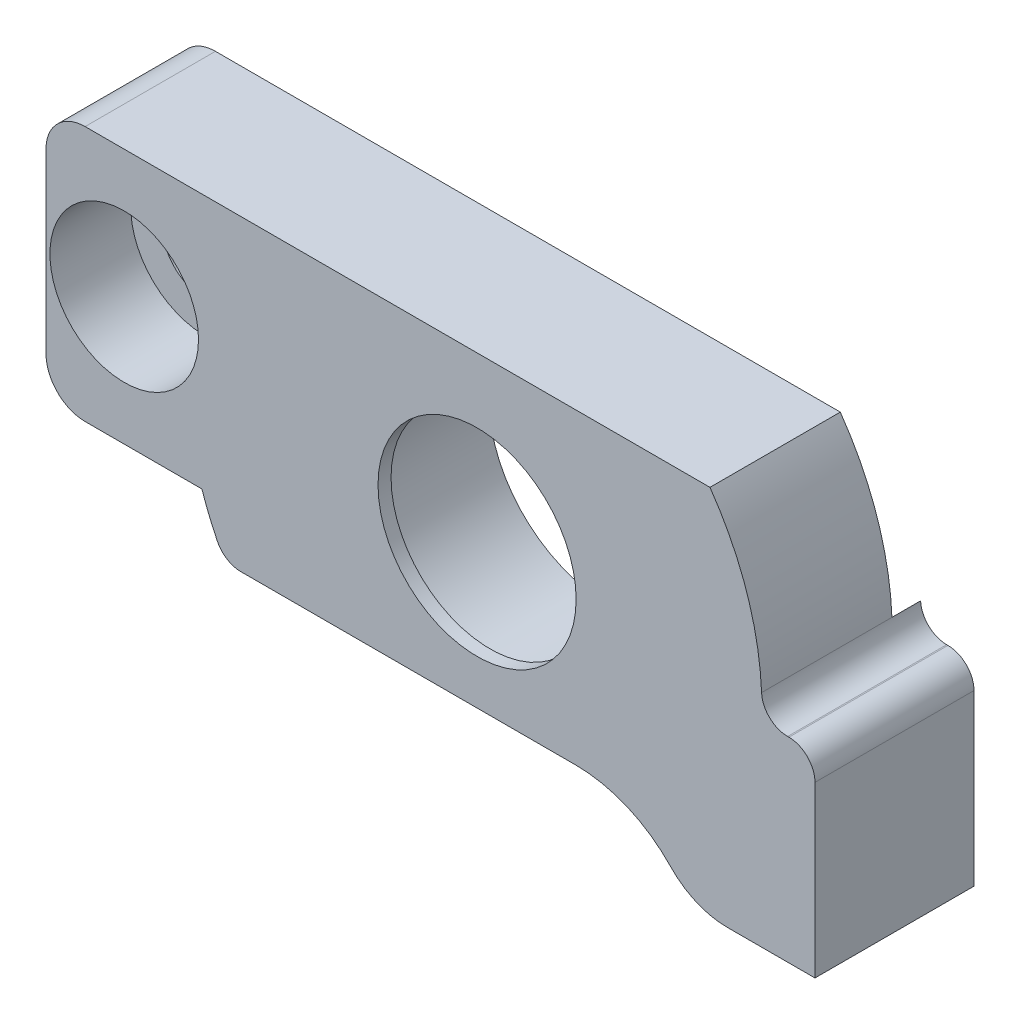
from build123d import *

# Parameters (mm, degrees)
RESSALTO_EXTRUS_O1_DEPTH = 5
ESBO_O2_R                = 3.8
ESBO_O2_R_2              = 1.65
CORTE_EXTRUS_O1_DEPTH    = 5
ESBO_O3_R                = 2.85
CORTE_EXTRUS_O2_DEPTH    = 3.1
ESBO_O4_R                = 4.55
CORTE_EXTRUS_O3_DEPTH    = 4.5
RESSALTO_EXTRUS_O2_START = -7.4
RESSALTO_EXTRUS_O2_DEPTH = 7.4
FILETE1_R                = 1
FILETE2_R                = 3
CORTE_EXTRUS_O4_DEPTH    = 2.4
RESSALTO_EXTRUS_O4_START = -5
RESSALTO_EXTRUS_O4_DEPTH = 5
FILETE3_R                = 1
CORTE_EXTRUS_O6_DEPTH    = 2.4
CORTE_EXTRUS_O7_DEPTH    = 1.3


with BuildPart() as part:
    # Esbo_o1 → Ressalto-extrus_o1 (new body)
    with BuildSketch(Plane.XY):
        with BuildLine():
            Line((-5.5, -4.8), (-5.5, -4.9))
            ThreePointArc((-5.5, -4.9), (-5.207106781, -5.607106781), (-4.5, -5.9))
            Line((-4.5, -5.9), (11, -5.9))
            ThreePointArc((11, -5.9), (12.060660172, -5.460660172), (12.5, -4.4))
            Line((12.5, -4.4), (12.5, 4.4))
            ThreePointArc((12.5, 4.4), (12.060660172, 5.460660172), (11, 5.9))
            Line((11, 5.9), (-11, 5.9))
            ThreePointArc((-11, 5.9), (-12.060660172, 5.460660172), (-12.5, 4.4))
            Line((-12.5, 4.4), (-12.5, -2.4))
            ThreePointArc((-12.5, -2.4), (-12.060660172, -3.460660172), (-11, -3.9))
            Line((-11, -3.9), (-6.4, -3.9))
            ThreePointArc((-6.4, -3.9), (-5.763603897, -4.163603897), (-5.5, -4.8))
        make_face()
    extrude(amount=RESSALTO_EXTRUS_O1_DEPTH)

    # Esbo_o2 → Corte-extrus_o1 (cut)
    with BuildSketch(Plane.XY.offset(5)):
        with Locations((4.03666999, -0.387184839)):
            Circle(ESBO_O2_R)
        with Locations((-9.5, 1)):
            Circle(ESBO_O2_R_2)
    extrude(amount=-CORTE_EXTRUS_O1_DEPTH, mode=Mode.SUBTRACT)

    # Esbo_o3 → Corte-extrus_o2 (cut)
    with BuildSketch(Plane(origin=(0, 0, 5), x_dir=(-1, 0, 0), z_dir=(0, 0, -1))):
        with Locations(Location((9.5, 1, 0), (0, 0, 180))):
            Circle(ESBO_O3_R)
    extrude(amount=CORTE_EXTRUS_O2_DEPTH, mode=Mode.SUBTRACT)

    # Esbo_o4 → Corte-extrus_o3 (cut)
    with BuildSketch(Plane(origin=(0, 0, 0), x_dir=(-1, 0, 0), z_dir=(0, 0, -1))):
        with Locations((-4.03666999, -0.387184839)):
            Circle(ESBO_O4_R)
    extrude(amount=-CORTE_EXTRUS_O3_DEPTH, mode=Mode.SUBTRACT)

    # Esbo_o6 → Ressalto-extrus_o2 (add)
    with BuildSketch(Plane.XY.offset(5).offset(RESSALTO_EXTRUS_O2_START)):
        with BuildLine():
            Line((14.96166999, -0.887184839), (17, -0.887184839))
            Line((17, -0.887184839), (17, -8.387184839))
            Line((17, -8.387184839), (12.165888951, -8.387184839))
            ThreePointArc((12.165888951, -8.387184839), (10.324776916, -6.565800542), (7.822009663, -5.9))
            Line((7.822009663, -5.9), (11, -5.9))
            ThreePointArc((11, -5.9), (12.060660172, -5.460660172), (12.5, -4.4))
            Line((12.5, -4.4), (12.5, 4.4))
            ThreePointArc((12.5, 4.4), (12.060660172, 5.460660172), (11, 5.9))
            Line((11, 5.9), (12.971261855, 5.9))
            ThreePointArc((12.971261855, 5.9), (14.452188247, 2.910178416), (14.96166999, -0.387184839))
            Line((14.96166999, -0.387184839), (14.96166999, -0.887184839))
        make_face()
    extrude(amount=RESSALTO_EXTRUS_O2_DEPTH)

    # Filete1
    filete1_edges = [part.edges().sort_by_distance(p)[0] for p in [
        (17, -0.887184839, 1.3),
        (14.96166999, -0.887184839, 1.3),
    ]]
    fillet(filete1_edges, radius=FILETE1_R)

    # Filete2
    filete2_edges = [part.edges().sort_by_distance(p)[0] for p in [
        (12.165888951, -8.387184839, 1.3),
    ]]
    fillet(filete2_edges, radius=FILETE2_R)

    # Esbo_o7 → Corte-extrus_o4 (cut)
    with BuildSketch(Plane(origin=(0, 0, -2.4), x_dir=(-1, 0, 0), z_dir=(0, 0, -1))):
        with BuildLine():
            Line((-12.5, 4.4), (-12.5, 5.9))
            Line((-12.5, 5.9), (-11, 5.9))
            ThreePointArc((-11, 5.9), (-12.060660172, 5.460660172), (-12.5, 4.4))
        make_face()
        with BuildLine():
            Line((-7.822009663, -5.9), (-11, -5.9))
            ThreePointArc((-11, -5.9), (-12.060660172, -5.460660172), (-12.5, -4.4))
            Line((-12.5, -4.4), (-12.5, -8.164138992))
            ThreePointArc((-12.5, -8.164138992), (-11.945393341, -7.866051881), (-11.46521865, -7.458772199))
            ThreePointArc((-11.46521865, -7.458772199), (-9.803343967, -6.306060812), (-7.822009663, -5.9))
        make_face()
    extrude(amount=-CORTE_EXTRUS_O4_DEPTH, mode=Mode.SUBTRACT)

    # Esbo_o9 → Ressalto-extrus_o4 (add)
    with BuildSketch(Plane.XY.offset(5).offset(RESSALTO_EXTRUS_O4_START)):
        with BuildLine():
            Line((-4.5, -5.9), (-5.626377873, -5.9))
            ThreePointArc((-5.626377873, -5.9), (-6.122112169, -4.922024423), (-6.519169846, -3.9))
            Line((-6.519169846, -3.9), (-6.4, -3.9))
            ThreePointArc((-6.4, -3.9), (-5.763603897, -4.163603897), (-5.5, -4.8))
            Line((-5.5, -4.8), (-5.5, -4.9))
            ThreePointArc((-5.5, -4.9), (-5.207106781, -5.607106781), (-4.5, -5.9))
        make_face()
    extrude(amount=RESSALTO_EXTRUS_O4_DEPTH)

    # Filete3
    filete3_edges = [part.edges().sort_by_distance(p)[0] for p in [
        (-5.626377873, -5.9, 2.5),
    ]]
    fillet(filete3_edges, radius=FILETE3_R)

    # Esbo_o12 → Corte-extrus_o6 (cut)
    with BuildSketch(Plane(origin=(0, 0, -2.4), x_dir=(-1, 0, 0), z_dir=(0, 0, -1))):
        with BuildLine():
            Line((-12.971261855, 5.9), (-12.5, 5.9))
            Line((-12.5, 5.9), (-12.5, -7.295706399))
            ThreePointArc((-12.5, -7.295706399), (-14.954709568, -0.777103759), (-12.971261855, 5.9))
        make_face()
    extrude(amount=-CORTE_EXTRUS_O6_DEPTH, mode=Mode.SUBTRACT)

    # Esbo_o13 → Corte-extrus_o7 (cut)
    with BuildSketch(Plane(origin=(0, 0, -2.4), x_dir=(-1, 0, 0), z_dir=(0, 0, -1))):
        with BuildLine():
            Line((-12.5, -8.164138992), (-12.5, -7.295706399))
            ThreePointArc((-12.5, -7.295706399), (-14.402498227, -3.837580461), (-14.952062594, 0.070886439))
            ThreePointArc((-14.952062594, 0.070886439), (-15.259059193, -0.608963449), (-15.951183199, -0.887184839))
            Line((-15.951183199, -0.887184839), (-16, -0.887184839))
            ThreePointArc((-16, -0.887184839), (-16.707106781, -1.180078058), (-17, -1.887184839))
            Line((-17, -1.887184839), (-17, -8.387184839))
            Line((-17, -8.387184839), (-13.63513243, -8.387184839))
            ThreePointArc((-13.63513243, -8.387184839), (-13.05671323, -8.330895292), (-12.5, -8.164138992))
        make_face()
    extrude(amount=-CORTE_EXTRUS_O7_DEPTH, mode=Mode.SUBTRACT)


solid = part.part
